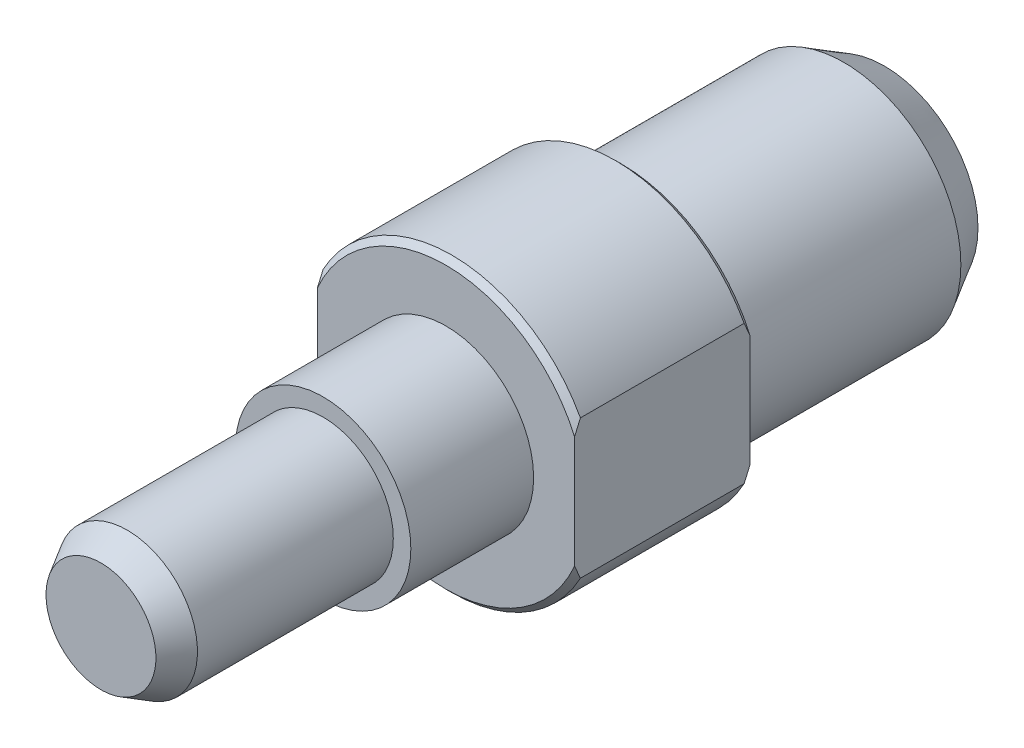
ISO-10303-21;
HEADER;
FILE_DESCRIPTION(('STEP AP214'),'2;1');
FILE_NAME('part.step','',(''),(''),'','','');
FILE_SCHEMA(('AUTOMOTIVE_DESIGN { 1 0 10303 214 1 1 1 1 }'));
ENDSEC;
DATA;
#1=APPLICATION_CONTEXT('core data for automotive mechanical design processes');
#2=APPLICATION_PROTOCOL_DEFINITION('international standard','automotive_design',2000,#1);
#3=PRODUCT_CONTEXT('',#1,'mechanical');
#4=PRODUCT('Part','Part','',(#3));
#5=PRODUCT_RELATED_PRODUCT_CATEGORY('part','',(#4));
#6=PRODUCT_DEFINITION_FORMATION('','',#4);
#7=PRODUCT_DEFINITION_CONTEXT('part definition',#1,'design');
#8=PRODUCT_DEFINITION('design','',#6,#7);
#9=PRODUCT_DEFINITION_SHAPE('','',#8);
#10=(LENGTH_UNIT() NAMED_UNIT(*) SI_UNIT(.MILLI.,.METRE.));
#11=(NAMED_UNIT(*) PLANE_ANGLE_UNIT() SI_UNIT($,.RADIAN.));
#12=(NAMED_UNIT(*) SI_UNIT($,.STERADIAN.) SOLID_ANGLE_UNIT());
#13=UNCERTAINTY_MEASURE_WITH_UNIT(LENGTH_MEASURE(1.E-05),#10,'distance_accuracy_value','');
#14=(GEOMETRIC_REPRESENTATION_CONTEXT(3) GLOBAL_UNCERTAINTY_ASSIGNED_CONTEXT((#13)) GLOBAL_UNIT_ASSIGNED_CONTEXT((#10,
#11,#12)) REPRESENTATION_CONTEXT('',''));
#15=CARTESIAN_POINT('',(0.,0.,0.));
#16=DIRECTION('',(0.,0.,1.));
#17=DIRECTION('',(1.,0.,0.));
#18=AXIS2_PLACEMENT_3D('',#15,#16,#17);
#19=CARTESIAN_POINT('',(0.,0.,0.));
#20=DIRECTION('',(0.,0.,1.));
#21=DIRECTION('',(1.,0.,0.));
#22=AXIS2_PLACEMENT_3D('',#19,#20,#21);
#23=PLANE('',#22);
#24=CARTESIAN_POINT('',(0.,0.,0.));
#25=DIRECTION('',(0.,0.,1.));
#26=DIRECTION('',(1.,0.,0.));
#27=AXIS2_PLACEMENT_3D('',#24,#25,#26);
#28=CIRCLE('',#27,10.);
#29=CARTESIAN_POINT('',(10.,0.,0.));
#30=VERTEX_POINT('',#29);
#31=EDGE_CURVE('E221',#30,#30,#28,.T.);
#32=ORIENTED_EDGE('',*,*,#31,.T.);
#33=EDGE_LOOP('',(#32));
#34=FACE_BOUND('',#33,.T.);
#35=DIRECTION('',(0.,-1.,0.));
#36=VECTOR('',#35,1.);
#37=CARTESIAN_POINT('',(11.,0.,0.));
#38=LINE('',#37,#36);
#39=CARTESIAN_POINT('',(11.,4.79583152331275,0.));
#40=VERTEX_POINT('',#39);
#41=CARTESIAN_POINT('',(11.,-4.79583152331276,0.));
#42=VERTEX_POINT('',#41);
#43=EDGE_CURVE('E212',#40,#42,#38,.T.);
#44=ORIENTED_EDGE('',*,*,#43,.T.);
#45=CARTESIAN_POINT('',(0.,0.,0.));
#46=DIRECTION('',(0.,0.,1.));
#47=DIRECTION('',(1.,0.,0.));
#48=AXIS2_PLACEMENT_3D('',#45,#46,#47);
#49=CIRCLE('',#48,12.);
#50=CARTESIAN_POINT('',(-11.,-4.79583152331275,0.));
#51=VERTEX_POINT('',#50);
#52=EDGE_CURVE('E398',#42,#51,#49,.F.);
#53=ORIENTED_EDGE('',*,*,#52,.T.);
#54=DIRECTION('',(0.,-1.,0.));
#55=VECTOR('',#54,1.);
#56=CARTESIAN_POINT('',(-11.,0.,0.));
#57=LINE('',#56,#55);
#58=CARTESIAN_POINT('',(-11.,4.79583152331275,0.));
#59=VERTEX_POINT('',#58);
#60=EDGE_CURVE('E87',#59,#51,#57,.T.);
#61=ORIENTED_EDGE('',*,*,#60,.F.);
#62=CARTESIAN_POINT('',(0.,0.,0.));
#63=DIRECTION('',(0.,0.,1.));
#64=DIRECTION('',(1.,0.,0.));
#65=AXIS2_PLACEMENT_3D('',#62,#63,#64);
#66=CIRCLE('',#65,12.);
#67=EDGE_CURVE('E397',#59,#40,#66,.F.);
#68=ORIENTED_EDGE('',*,*,#67,.T.);
#69=EDGE_LOOP('',(#44,#53,#61,#68));
#70=FACE_BOUND('',#69,.T.);
#71=ADVANCED_FACE('F14',(#34,#70),#23,.F.);
#72=CARTESIAN_POINT('',(0.,0.,15.));
#73=DIRECTION('',(0.,0.,-1.));
#74=DIRECTION('',(-1.,0.,0.));
#75=AXIS2_PLACEMENT_3D('',#72,#73,#74);
#76=CYLINDRICAL_SURFACE('',#75,12.5);
#77=DIRECTION('',(0.,0.,1.));
#78=VECTOR('',#77,1.);
#79=CARTESIAN_POINT('',(11.,5.93717104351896,-22.5));
#80=LINE('',#79,#78);
#81=CARTESIAN_POINT('',(11.,5.93717104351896,0.49999999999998));
#82=VERTEX_POINT('',#81);
#83=CARTESIAN_POINT('',(11.,5.93717104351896,14.5));
#84=VERTEX_POINT('',#83);
#85=EDGE_CURVE('E186',#82,#84,#80,.T.);
#86=ORIENTED_EDGE('',*,*,#85,.F.);
#87=CARTESIAN_POINT('',(0.,0.,0.49999999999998));
#88=DIRECTION('',(0.,0.,1.));
#89=DIRECTION('',(1.,0.,0.));
#90=AXIS2_PLACEMENT_3D('',#87,#88,#89);
#91=CIRCLE('',#90,12.5);
#92=CARTESIAN_POINT('',(-11.,5.93717104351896,0.49999999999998));
#93=VERTEX_POINT('',#92);
#94=EDGE_CURVE('E9',#82,#93,#91,.T.);
#95=ORIENTED_EDGE('',*,*,#94,.T.);
#96=DIRECTION('',(0.,0.,1.));
#97=VECTOR('',#96,1.);
#98=CARTESIAN_POINT('',(-11.,5.93717104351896,-22.5));
#99=LINE('',#98,#97);
#100=CARTESIAN_POINT('',(-11.,5.93717104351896,14.5));
#101=VERTEX_POINT('',#100);
#102=EDGE_CURVE('E102',#93,#101,#99,.T.);
#103=ORIENTED_EDGE('',*,*,#102,.T.);
#104=CARTESIAN_POINT('',(0.,0.,14.5));
#105=DIRECTION('',(0.,0.,1.));
#106=DIRECTION('',(1.,0.,0.));
#107=AXIS2_PLACEMENT_3D('',#104,#105,#106);
#108=CIRCLE('',#107,12.5);
#109=EDGE_CURVE('E23',#101,#84,#108,.F.);
#110=ORIENTED_EDGE('',*,*,#109,.T.);
#111=EDGE_LOOP('',(#86,#95,#103,#110));
#112=FACE_BOUND('',#111,.T.);
#113=ADVANCED_FACE('F185',(#112),#76,.T.);
#114=DIRECTION('',(0.,0.,1.));
#115=VECTOR('',#114,1.);
#116=CARTESIAN_POINT('',(-11.,-5.93717104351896,-22.5));
#117=LINE('',#116,#115);
#118=CARTESIAN_POINT('',(-11.,-5.93717104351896,0.49999999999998));
#119=VERTEX_POINT('',#118);
#120=CARTESIAN_POINT('',(-11.,-5.93717104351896,14.5));
#121=VERTEX_POINT('',#120);
#122=EDGE_CURVE('E84',#119,#121,#117,.T.);
#123=ORIENTED_EDGE('',*,*,#122,.F.);
#124=CARTESIAN_POINT('',(0.,0.,0.49999999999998));
#125=DIRECTION('',(0.,0.,1.));
#126=DIRECTION('',(1.,0.,0.));
#127=AXIS2_PLACEMENT_3D('',#124,#125,#126);
#128=CIRCLE('',#127,12.5);
#129=CARTESIAN_POINT('',(11.,-5.93717104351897,0.499999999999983));
#130=VERTEX_POINT('',#129);
#131=EDGE_CURVE('E98',#119,#130,#128,.T.);
#132=ORIENTED_EDGE('',*,*,#131,.T.);
#133=DIRECTION('',(0.,0.,1.));
#134=VECTOR('',#133,1.);
#135=CARTESIAN_POINT('',(11.,-5.93717104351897,-22.5));
#136=LINE('',#135,#134);
#137=CARTESIAN_POINT('',(11.,-5.93717104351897,14.5));
#138=VERTEX_POINT('',#137);
#139=EDGE_CURVE('E193',#130,#138,#136,.T.);
#140=ORIENTED_EDGE('',*,*,#139,.T.);
#141=CARTESIAN_POINT('',(0.,0.,14.5));
#142=DIRECTION('',(0.,0.,1.));
#143=DIRECTION('',(1.,0.,0.));
#144=AXIS2_PLACEMENT_3D('',#141,#142,#143);
#145=CIRCLE('',#144,12.5);
#146=EDGE_CURVE('E101',#138,#121,#145,.F.);
#147=ORIENTED_EDGE('',*,*,#146,.T.);
#148=EDGE_LOOP('',(#123,#132,#140,#147));
#149=FACE_BOUND('',#148,.T.);
#150=ADVANCED_FACE('F96',(#149),#76,.T.);
#151=CARTESIAN_POINT('',(0.,0.,15.));
#152=DIRECTION('',(0.,0.,1.));
#153=DIRECTION('',(1.,0.,0.));
#154=AXIS2_PLACEMENT_3D('',#151,#152,#153);
#155=PLANE('',#154);
#156=CARTESIAN_POINT('',(0.,0.,15.));
#157=DIRECTION('',(0.,0.,1.));
#158=DIRECTION('',(1.,0.,0.));
#159=AXIS2_PLACEMENT_3D('',#156,#157,#158);
#160=CIRCLE('',#159,7.5);
#161=CARTESIAN_POINT('',(7.5,0.,15.));
#162=VERTEX_POINT('',#161);
#163=EDGE_CURVE('E218',#162,#162,#160,.T.);
#164=ORIENTED_EDGE('',*,*,#163,.F.);
#165=EDGE_LOOP('',(#164));
#166=FACE_BOUND('',#165,.T.);
#167=DIRECTION('',(0.,-1.,0.));
#168=VECTOR('',#167,1.);
#169=CARTESIAN_POINT('',(-11.,5.93717104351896,15.));
#170=LINE('',#169,#168);
#171=CARTESIAN_POINT('',(-11.,4.79583152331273,15.));
#172=VERTEX_POINT('',#171);
#173=CARTESIAN_POINT('',(-11.,-4.79583152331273,15.));
#174=VERTEX_POINT('',#173);
#175=EDGE_CURVE('E103',#172,#174,#170,.T.);
#176=ORIENTED_EDGE('',*,*,#175,.T.);
#177=CARTESIAN_POINT('',(0.,0.,15.));
#178=DIRECTION('',(0.,0.,1.));
#179=DIRECTION('',(1.,0.,0.));
#180=AXIS2_PLACEMENT_3D('',#177,#178,#179);
#181=CIRCLE('',#180,12.);
#182=CARTESIAN_POINT('',(11.,-4.79583152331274,15.));
#183=VERTEX_POINT('',#182);
#184=EDGE_CURVE('E179',#174,#183,#181,.T.);
#185=ORIENTED_EDGE('',*,*,#184,.T.);
#186=DIRECTION('',(0.,-1.,0.));
#187=VECTOR('',#186,1.);
#188=CARTESIAN_POINT('',(11.,5.93717104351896,15.));
#189=LINE('',#188,#187);
#190=CARTESIAN_POINT('',(11.,4.79583152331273,15.));
#191=VERTEX_POINT('',#190);
#192=EDGE_CURVE('E194',#191,#183,#189,.T.);
#193=ORIENTED_EDGE('',*,*,#192,.F.);
#194=CARTESIAN_POINT('',(0.,0.,15.));
#195=DIRECTION('',(0.,0.,1.));
#196=DIRECTION('',(1.,0.,0.));
#197=AXIS2_PLACEMENT_3D('',#194,#195,#196);
#198=CIRCLE('',#197,12.);
#199=EDGE_CURVE('E91',#191,#172,#198,.T.);
#200=ORIENTED_EDGE('',*,*,#199,.T.);
#201=EDGE_LOOP('',(#176,#185,#193,#200));
#202=FACE_BOUND('',#201,.T.);
#203=ADVANCED_FACE('F199',(#166,#202),#155,.T.);
#204=CARTESIAN_POINT('',(0.,0.,0.));
#205=DIRECTION('',(0.,0.,-1.));
#206=DIRECTION('',(-1.,0.,0.));
#207=AXIS2_PLACEMENT_3D('',#204,#205,#206);
#208=CYLINDRICAL_SURFACE('',#207,10.);
#209=CARTESIAN_POINT('',(0.,0.,-19.0358983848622));
#210=DIRECTION('',(0.,0.,1.));
#211=DIRECTION('',(1.,0.,0.));
#212=AXIS2_PLACEMENT_3D('',#209,#210,#211);
#213=CIRCLE('',#212,10.);
#214=CARTESIAN_POINT('',(10.,0.,-19.0358983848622));
#215=VERTEX_POINT('',#214);
#216=EDGE_CURVE('E201',#215,#215,#213,.T.);
#217=ORIENTED_EDGE('',*,*,#216,.T.);
#218=EDGE_LOOP('',(#217));
#219=FACE_BOUND('',#218,.T.);
#220=ORIENTED_EDGE('',*,*,#31,.F.);
#221=EDGE_LOOP('',(#220));
#222=FACE_BOUND('',#221,.T.);
#223=ADVANCED_FACE('F228',(#219,#222),#208,.T.);
#224=CARTESIAN_POINT('',(0.,0.,25.5));
#225=DIRECTION('',(0.,0.,-1.));
#226=DIRECTION('',(-1.,0.,0.));
#227=AXIS2_PLACEMENT_3D('',#224,#225,#226);
#228=CYLINDRICAL_SURFACE('',#227,7.5);
#229=CARTESIAN_POINT('',(0.,0.,25.5));
#230=DIRECTION('',(0.,0.,1.));
#231=DIRECTION('',(1.,0.,0.));
#232=AXIS2_PLACEMENT_3D('',#229,#230,#231);
#233=CIRCLE('',#232,7.5);
#234=CARTESIAN_POINT('',(7.5,0.,25.5));
#235=VERTEX_POINT('',#234);
#236=EDGE_CURVE('E215',#235,#235,#233,.T.);
#237=ORIENTED_EDGE('',*,*,#236,.F.);
#238=EDGE_LOOP('',(#237));
#239=FACE_BOUND('',#238,.T.);
#240=ORIENTED_EDGE('',*,*,#163,.T.);
#241=EDGE_LOOP('',(#240));
#242=FACE_BOUND('',#241,.T.);
#243=ADVANCED_FACE('F230',(#239,#242),#228,.T.);
#244=CARTESIAN_POINT('',(0.,0.,25.5));
#245=DIRECTION('',(0.,0.,1.));
#246=DIRECTION('',(1.,0.,0.));
#247=AXIS2_PLACEMENT_3D('',#244,#245,#246);
#248=PLANE('',#247);
#249=CARTESIAN_POINT('',(0.,0.,25.5));
#250=DIRECTION('',(0.,0.,1.));
#251=DIRECTION('',(1.,0.,0.));
#252=AXIS2_PLACEMENT_3D('',#249,#250,#251);
#253=CIRCLE('',#252,6.);
#254=CARTESIAN_POINT('',(6.,0.,25.5));
#255=VERTEX_POINT('',#254);
#256=EDGE_CURVE('E111',#255,#255,#253,.T.);
#257=ORIENTED_EDGE('',*,*,#256,.F.);
#258=EDGE_LOOP('',(#257));
#259=FACE_BOUND('',#258,.T.);
#260=ORIENTED_EDGE('',*,*,#236,.T.);
#261=EDGE_LOOP('',(#260));
#262=FACE_BOUND('',#261,.T.);
#263=ADVANCED_FACE('F232',(#259,#262),#248,.T.);
#264=CARTESIAN_POINT('',(0.,0.,44.5));
#265=DIRECTION('',(0.,0.,-1.));
#266=DIRECTION('',(-1.,0.,0.));
#267=AXIS2_PLACEMENT_3D('',#264,#265,#266);
#268=CYLINDRICAL_SURFACE('',#267,6.);
#269=CARTESIAN_POINT('',(0.,0.,42.2483339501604));
#270=DIRECTION('',(0.,0.,-1.));
#271=DIRECTION('',(-1.,0.,0.));
#272=AXIS2_PLACEMENT_3D('',#269,#270,#271);
#273=CIRCLE('',#272,6.);
#274=CARTESIAN_POINT('',(-6.,0.,42.2483339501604));
#275=VERTEX_POINT('',#274);
#276=EDGE_CURVE('E269',#275,#275,#273,.T.);
#277=ORIENTED_EDGE('',*,*,#276,.T.);
#278=EDGE_LOOP('',(#277));
#279=FACE_BOUND('',#278,.T.);
#280=ORIENTED_EDGE('',*,*,#256,.T.);
#281=EDGE_LOOP('',(#280));
#282=FACE_BOUND('',#281,.T.);
#283=ADVANCED_FACE('F130',(#279,#282),#268,.T.);
#284=CARTESIAN_POINT('',(11.,5.93717104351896,-22.5));
#285=DIRECTION('',(-1.,0.,0.));
#286=DIRECTION('',(0.,-1.,0.));
#287=AXIS2_PLACEMENT_3D('',#284,#285,#286);
#288=PLANE('',#287);
#289=ORIENTED_EDGE('',*,*,#139,.F.);
#290=CARTESIAN_POINT('',(11.,-5.93717104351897,0.49999999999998));
#291=CARTESIAN_POINT('',(11.,-5.8433495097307,0.455437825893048));
#292=CARTESIAN_POINT('',(11.,-5.7492102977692,0.411541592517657));
#293=CARTESIAN_POINT('',(11.,-5.56030813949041,0.32517620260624));
#294=CARTESIAN_POINT('',(11.,-5.46554535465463,0.282706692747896));
#295=CARTESIAN_POINT('',(11.,-5.27535928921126,0.199266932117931));
#296=CARTESIAN_POINT('',(11.,-5.17993599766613,0.158296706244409));
#297=CARTESIAN_POINT('',(11.,-4.98839837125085,0.0779369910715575));
#298=CARTESIAN_POINT('',(11.,-4.89228386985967,0.0385478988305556));
#299=CARTESIAN_POINT('',(11.,-4.79583152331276,0.));
#300=B_SPLINE_CURVE_WITH_KNOTS('',3,(#290,#291,#292,#293,#294,#295,#296,#297,#298,#299),
.UNSPECIFIED.,.F.,.F.,(4,2,2,2,4),(0.,0.311598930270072,0.623120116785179,0.934646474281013,
1.24625057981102),.UNSPECIFIED.);
#301=EDGE_CURVE('E106',#130,#42,#300,.T.);
#302=ORIENTED_EDGE('',*,*,#301,.T.);
#303=ORIENTED_EDGE('',*,*,#43,.F.);
#304=CARTESIAN_POINT('',(11.,4.79583152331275,0.));
#305=CARTESIAN_POINT('',(11.,4.89228386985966,0.0385478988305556));
#306=CARTESIAN_POINT('',(11.,4.98839837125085,0.0779369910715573));
#307=CARTESIAN_POINT('',(11.,5.17993599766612,0.158296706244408));
#308=CARTESIAN_POINT('',(11.,5.27535928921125,0.19926693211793));
#309=CARTESIAN_POINT('',(11.,5.46554535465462,0.282706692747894));
#310=CARTESIAN_POINT('',(11.,5.5603081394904,0.325176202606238));
#311=CARTESIAN_POINT('',(11.,5.7492102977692,0.411541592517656));
#312=CARTESIAN_POINT('',(11.,5.84334950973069,0.455437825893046));
#313=CARTESIAN_POINT('',(11.,5.93717104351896,0.49999999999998));
#314=B_SPLINE_CURVE_WITH_KNOTS('',3,(#304,#305,#306,#307,#308,#309,#310,#311,#312,#313),
.UNSPECIFIED.,.F.,.F.,(4,2,2,2,4),(0.,0.311604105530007,0.623130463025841,0.934651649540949,
1.24625057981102),.UNSPECIFIED.);
#315=EDGE_CURVE('E109',#40,#82,#314,.T.);
#316=ORIENTED_EDGE('',*,*,#315,.T.);
#317=ORIENTED_EDGE('',*,*,#85,.T.);
#318=CARTESIAN_POINT('',(11.,5.93717104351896,14.5));
#319=CARTESIAN_POINT('',(11.,5.84334950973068,14.5445621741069));
#320=CARTESIAN_POINT('',(11.,5.74921029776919,14.5884584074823));
#321=CARTESIAN_POINT('',(11.,5.56030813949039,14.6748237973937));
#322=CARTESIAN_POINT('',(11.,5.46554535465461,14.7172933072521));
#323=CARTESIAN_POINT('',(11.,5.27535928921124,14.8007330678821));
#324=CARTESIAN_POINT('',(11.,5.1799359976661,14.8417032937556));
#325=CARTESIAN_POINT('',(11.,4.98839837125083,14.9220630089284));
#326=CARTESIAN_POINT('',(11.,4.89228386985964,14.9614521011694));
#327=CARTESIAN_POINT('',(11.,4.79583152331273,15.));
#328=B_SPLINE_CURVE_WITH_KNOTS('',3,(#318,#319,#320,#321,#322,#323,#324,#325,#326,#327),
.UNSPECIFIED.,.F.,.F.,(4,2,2,2,4),(0.,0.311598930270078,0.623120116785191,0.934646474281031,
1.24625057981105),.UNSPECIFIED.);
#329=EDGE_CURVE('E107',#84,#191,#328,.T.);
#330=ORIENTED_EDGE('',*,*,#329,.T.);
#331=ORIENTED_EDGE('',*,*,#192,.T.);
#332=CARTESIAN_POINT('',(11.,-4.79583152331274,15.));
#333=CARTESIAN_POINT('',(11.,-4.89228386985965,14.9614521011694));
#334=CARTESIAN_POINT('',(11.,-4.98839837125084,14.9220630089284));
#335=CARTESIAN_POINT('',(11.,-5.17993599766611,14.8417032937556));
#336=CARTESIAN_POINT('',(11.,-5.27535928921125,14.8007330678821));
#337=CARTESIAN_POINT('',(11.,-5.46554535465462,14.7172933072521));
#338=CARTESIAN_POINT('',(11.,-5.5603081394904,14.6748237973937));
#339=CARTESIAN_POINT('',(11.,-5.7492102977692,14.5884584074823));
#340=CARTESIAN_POINT('',(11.,-5.84334950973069,14.5445621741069));
#341=CARTESIAN_POINT('',(11.,-5.93717104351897,14.5));
#342=B_SPLINE_CURVE_WITH_KNOTS('',3,(#332,#333,#334,#335,#336,#337,#338,#339,#340,#341),
.UNSPECIFIED.,.F.,.F.,(4,2,2,2,4),(0.,0.311604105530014,0.623130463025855,0.934651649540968,
1.24625057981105),.UNSPECIFIED.);
#343=EDGE_CURVE('E140',#183,#138,#342,.T.);
#344=ORIENTED_EDGE('',*,*,#343,.T.);
#345=EDGE_LOOP('',(#289,#302,#303,#316,#317,#330,#331,#344));
#346=FACE_BOUND('',#345,.T.);
#347=ADVANCED_FACE('F125',(#346),#288,.F.);
#348=CARTESIAN_POINT('',(-11.,5.93717104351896,-22.5));
#349=DIRECTION('',(-1.,0.,0.));
#350=DIRECTION('',(0.,0.,1.));
#351=AXIS2_PLACEMENT_3D('',#348,#349,#350);
#352=PLANE('',#351);
#353=ORIENTED_EDGE('',*,*,#60,.T.);
#354=CARTESIAN_POINT('',(-11.,-4.79583152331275,0.));
#355=CARTESIAN_POINT('',(-11.,-4.89228386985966,0.0385478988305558));
#356=CARTESIAN_POINT('',(-11.,-4.98839837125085,0.0779369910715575));
#357=CARTESIAN_POINT('',(-11.,-5.17993599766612,0.158296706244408));
#358=CARTESIAN_POINT('',(-11.,-5.27535928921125,0.19926693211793));
#359=CARTESIAN_POINT('',(-11.,-5.46554535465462,0.282706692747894));
#360=CARTESIAN_POINT('',(-11.,-5.5603081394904,0.325176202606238));
#361=CARTESIAN_POINT('',(-11.,-5.7492102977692,0.411541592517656));
#362=CARTESIAN_POINT('',(-11.,-5.84334950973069,0.455437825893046));
#363=CARTESIAN_POINT('',(-11.,-5.93717104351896,0.49999999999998));
#364=B_SPLINE_CURVE_WITH_KNOTS('',3,(#354,#355,#356,#357,#358,#359,#360,#361,#362,#363),
.UNSPECIFIED.,.F.,.F.,(4,2,2,2,4),(0.,0.311604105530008,0.623130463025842,0.934651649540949,
1.24625057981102),.UNSPECIFIED.);
#365=EDGE_CURVE('E81',#51,#119,#364,.T.);
#366=ORIENTED_EDGE('',*,*,#365,.T.);
#367=ORIENTED_EDGE('',*,*,#122,.T.);
#368=CARTESIAN_POINT('',(-11.,-5.93717104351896,14.5));
#369=CARTESIAN_POINT('',(-11.,-5.84334950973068,14.5445621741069));
#370=CARTESIAN_POINT('',(-11.,-5.74921029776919,14.5884584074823));
#371=CARTESIAN_POINT('',(-11.,-5.56030813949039,14.6748237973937));
#372=CARTESIAN_POINT('',(-11.,-5.46554535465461,14.7172933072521));
#373=CARTESIAN_POINT('',(-11.,-5.27535928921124,14.8007330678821));
#374=CARTESIAN_POINT('',(-11.,-5.1799359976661,14.8417032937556));
#375=CARTESIAN_POINT('',(-11.,-4.98839837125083,14.9220630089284));
#376=CARTESIAN_POINT('',(-11.,-4.89228386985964,14.9614521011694));
#377=CARTESIAN_POINT('',(-11.,-4.79583152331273,15.));
#378=B_SPLINE_CURVE_WITH_KNOTS('',3,(#368,#369,#370,#371,#372,#373,#374,#375,#376,#377),
.UNSPECIFIED.,.F.,.F.,(4,2,2,2,4),(0.,0.311598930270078,0.623120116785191,0.934646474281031,
1.24625057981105),.UNSPECIFIED.);
#379=EDGE_CURVE('E92',#121,#174,#378,.T.);
#380=ORIENTED_EDGE('',*,*,#379,.T.);
#381=ORIENTED_EDGE('',*,*,#175,.F.);
#382=CARTESIAN_POINT('',(-11.,4.79583152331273,15.));
#383=CARTESIAN_POINT('',(-11.,4.89228386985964,14.9614521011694));
#384=CARTESIAN_POINT('',(-11.,4.98839837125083,14.9220630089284));
#385=CARTESIAN_POINT('',(-11.,5.1799359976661,14.8417032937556));
#386=CARTESIAN_POINT('',(-11.,5.27535928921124,14.8007330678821));
#387=CARTESIAN_POINT('',(-11.,5.46554535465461,14.7172933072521));
#388=CARTESIAN_POINT('',(-11.,5.56030813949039,14.6748237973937));
#389=CARTESIAN_POINT('',(-11.,5.74921029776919,14.5884584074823));
#390=CARTESIAN_POINT('',(-11.,5.84334950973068,14.5445621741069));
#391=CARTESIAN_POINT('',(-11.,5.93717104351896,14.5));
#392=B_SPLINE_CURVE_WITH_KNOTS('',3,(#382,#383,#384,#385,#386,#387,#388,#389,#390,#391),
.UNSPECIFIED.,.F.,.F.,(4,2,2,2,4),(0.,0.311604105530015,0.623130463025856,0.934651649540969,
1.24625057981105),.UNSPECIFIED.);
#393=EDGE_CURVE('E30',#172,#101,#392,.T.);
#394=ORIENTED_EDGE('',*,*,#393,.T.);
#395=ORIENTED_EDGE('',*,*,#102,.F.);
#396=CARTESIAN_POINT('',(-11.,5.93717104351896,0.49999999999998));
#397=CARTESIAN_POINT('',(-11.,5.84334950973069,0.455437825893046));
#398=CARTESIAN_POINT('',(-11.,5.7492102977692,0.411541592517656));
#399=CARTESIAN_POINT('',(-11.,5.5603081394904,0.325176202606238));
#400=CARTESIAN_POINT('',(-11.,5.46554535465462,0.282706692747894));
#401=CARTESIAN_POINT('',(-11.,5.27535928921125,0.19926693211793));
#402=CARTESIAN_POINT('',(-11.,5.17993599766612,0.158296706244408));
#403=CARTESIAN_POINT('',(-11.,4.98839837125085,0.0779369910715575));
#404=CARTESIAN_POINT('',(-11.,4.89228386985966,0.0385478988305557));
#405=CARTESIAN_POINT('',(-11.,4.79583152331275,0.));
#406=B_SPLINE_CURVE_WITH_KNOTS('',3,(#396,#397,#398,#399,#400,#401,#402,#403,#404,#405),
.UNSPECIFIED.,.F.,.F.,(4,2,2,2,4),(0.,0.311598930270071,0.623120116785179,0.934646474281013,
1.24625057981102),.UNSPECIFIED.);
#407=EDGE_CURVE('E38',#93,#59,#406,.T.);
#408=ORIENTED_EDGE('',*,*,#407,.T.);
#409=EDGE_LOOP('',(#353,#366,#367,#380,#381,#394,#395,#408));
#410=FACE_BOUND('',#409,.T.);
#411=ADVANCED_FACE('F83',(#410),#352,.T.);
#412=CARTESIAN_POINT('',(0.,0.,0.49999999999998));
#413=DIRECTION('',(0.,0.,1.));
#414=DIRECTION('',(1.,0.,0.));
#415=AXIS2_PLACEMENT_3D('',#412,#413,#414);
#416=CONICAL_SURFACE('',#415,12.5,0.785398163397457);
#417=ORIENTED_EDGE('',*,*,#365,.F.);
#418=ORIENTED_EDGE('',*,*,#52,.F.);
#419=ORIENTED_EDGE('',*,*,#301,.F.);
#420=ORIENTED_EDGE('',*,*,#131,.F.);
#421=EDGE_LOOP('',(#417,#418,#419,#420));
#422=FACE_BOUND('',#421,.T.);
#423=ADVANCED_FACE('F105',(#422),#416,.T.);
#424=CARTESIAN_POINT('',(0.,0.,15.));
#425=DIRECTION('',(0.,0.,-1.));
#426=DIRECTION('',(-1.,0.,0.));
#427=AXIS2_PLACEMENT_3D('',#424,#425,#426);
#428=CONICAL_SURFACE('',#427,12.,0.785398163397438);
#429=ORIENTED_EDGE('',*,*,#379,.F.);
#430=ORIENTED_EDGE('',*,*,#146,.F.);
#431=ORIENTED_EDGE('',*,*,#343,.F.);
#432=ORIENTED_EDGE('',*,*,#184,.F.);
#433=EDGE_LOOP('',(#429,#430,#431,#432));
#434=FACE_BOUND('',#433,.T.);
#435=ADVANCED_FACE('F152',(#434),#428,.T.);
#436=CARTESIAN_POINT('',(0.,0.,0.49999999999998));
#437=DIRECTION('',(0.,0.,1.));
#438=DIRECTION('',(1.,0.,0.));
#439=AXIS2_PLACEMENT_3D('',#436,#437,#438);
#440=CONICAL_SURFACE('',#439,12.5,0.785398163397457);
#441=ORIENTED_EDGE('',*,*,#315,.F.);
#442=ORIENTED_EDGE('',*,*,#67,.F.);
#443=ORIENTED_EDGE('',*,*,#407,.F.);
#444=ORIENTED_EDGE('',*,*,#94,.F.);
#445=EDGE_LOOP('',(#441,#442,#443,#444));
#446=FACE_BOUND('',#445,.T.);
#447=ADVANCED_FACE('F155',(#446),#440,.T.);
#448=CARTESIAN_POINT('',(0.,0.,15.));
#449=DIRECTION('',(0.,0.,-1.));
#450=DIRECTION('',(-1.,0.,0.));
#451=AXIS2_PLACEMENT_3D('',#448,#449,#450);
#452=CONICAL_SURFACE('',#451,12.,0.785398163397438);
#453=ORIENTED_EDGE('',*,*,#329,.F.);
#454=ORIENTED_EDGE('',*,*,#109,.F.);
#455=ORIENTED_EDGE('',*,*,#393,.F.);
#456=ORIENTED_EDGE('',*,*,#199,.F.);
#457=EDGE_LOOP('',(#453,#454,#455,#456));
#458=FACE_BOUND('',#457,.T.);
#459=ADVANCED_FACE('F16',(#458),#452,.T.);
#460=CARTESIAN_POINT('',(0.,0.,-12.9592827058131));
#461=DIRECTION('',(0.,0.,1.));
#462=DIRECTION('',(1.,0.,0.));
#463=AXIS2_PLACEMENT_3D('',#460,#461,#462);
#464=CONICAL_SURFACE('',#463,13.5083356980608,0.523598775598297);
#465=CARTESIAN_POINT('',(0.,0.,-22.5));
#466=DIRECTION('',(0.,0.,-1.));
#467=DIRECTION('',(-1.,0.,0.));
#468=AXIS2_PLACEMENT_3D('',#465,#466,#467);
#469=CIRCLE('',#468,8.);
#470=CARTESIAN_POINT('',(-8.,0.,-22.5));
#471=VERTEX_POINT('',#470);
#472=EDGE_CURVE('E204',#471,#471,#469,.T.);
#473=ORIENTED_EDGE('',*,*,#472,.F.);
#474=EDGE_LOOP('',(#473));
#475=FACE_BOUND('',#474,.T.);
#476=ORIENTED_EDGE('',*,*,#216,.F.);
#477=EDGE_LOOP('',(#476));
#478=FACE_BOUND('',#477,.T.);
#479=ADVANCED_FACE('F257',(#475,#478),#464,.T.);
#480=CARTESIAN_POINT('',(0.,0.,-22.5));
#481=DIRECTION('',(0.,0.,1.));
#482=DIRECTION('',(1.,0.,0.));
#483=AXIS2_PLACEMENT_3D('',#480,#481,#482);
#484=PLANE('',#483);
#485=ORIENTED_EDGE('',*,*,#472,.T.);
#486=EDGE_LOOP('',(#485));
#487=FACE_BOUND('',#486,.T.);
#488=ADVANCED_FACE('F254',(#487),#484,.F.);
#489=CARTESIAN_POINT('',(0.,0.,44.5));
#490=DIRECTION('',(0.,0.,-1.));
#491=DIRECTION('',(-1.,0.,0.));
#492=AXIS2_PLACEMENT_3D('',#489,#490,#491);
#493=CONICAL_SURFACE('',#492,4.7,0.523598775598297);
#494=CARTESIAN_POINT('',(0.,0.,44.5));
#495=DIRECTION('',(0.,0.,-1.));
#496=DIRECTION('',(-1.,0.,0.));
#497=AXIS2_PLACEMENT_3D('',#494,#495,#496);
#498=CIRCLE('',#497,4.7);
#499=CARTESIAN_POINT('',(-4.7,0.,44.5));
#500=VERTEX_POINT('',#499);
#501=EDGE_CURVE('E271',#500,#500,#498,.T.);
#502=ORIENTED_EDGE('',*,*,#501,.T.);
#503=EDGE_LOOP('',(#502));
#504=FACE_BOUND('',#503,.T.);
#505=ORIENTED_EDGE('',*,*,#276,.F.);
#506=EDGE_LOOP('',(#505));
#507=FACE_BOUND('',#506,.T.);
#508=ADVANCED_FACE('F256',(#504,#507),#493,.T.);
#509=CARTESIAN_POINT('',(0.,0.,44.5));
#510=DIRECTION('',(0.,0.,1.));
#511=DIRECTION('',(1.,0.,0.));
#512=AXIS2_PLACEMENT_3D('',#509,#510,#511);
#513=PLANE('',#512);
#514=ORIENTED_EDGE('',*,*,#501,.F.);
#515=EDGE_LOOP('',(#514));
#516=FACE_BOUND('',#515,.T.);
#517=ADVANCED_FACE('F134',(#516),#513,.T.);
#518=CLOSED_SHELL('',(#71,#113,#150,#203,#223,#243,#263,#283,#347,#411,#423,#435,#447,#459,#479,
#488,#508,#517));
#519=MANIFOLD_SOLID_BREP('B1',#518);
#520=ADVANCED_BREP_SHAPE_REPRESENTATION('',(#18,#519),#14);
#521=SHAPE_DEFINITION_REPRESENTATION(#9,#520);
ENDSEC;
END-ISO-10303-21;
